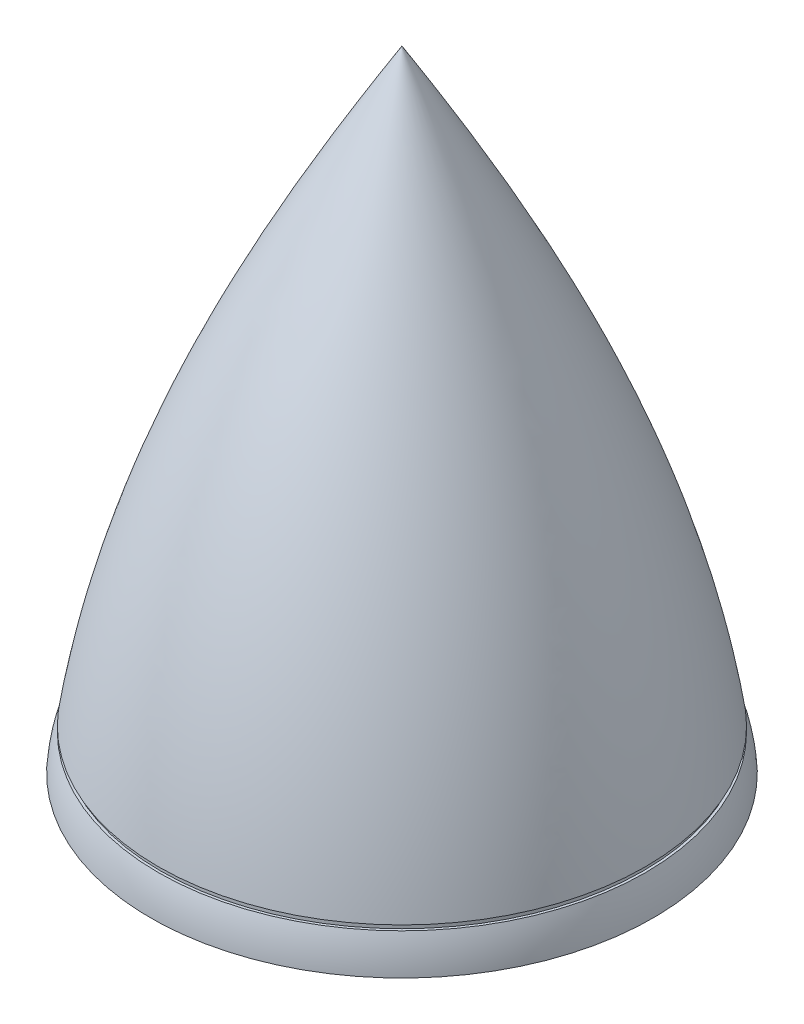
ISO-10303-21;
HEADER;
FILE_DESCRIPTION(('STEP AP214'),'2;1');
FILE_NAME('part.step','',(''),(''),'','','');
FILE_SCHEMA(('AUTOMOTIVE_DESIGN { 1 0 10303 214 1 1 1 1 }'));
ENDSEC;
DATA;
#1=APPLICATION_CONTEXT('core data for automotive mechanical design processes');
#2=APPLICATION_PROTOCOL_DEFINITION('international standard','automotive_design',2000,#1);
#3=PRODUCT_CONTEXT('',#1,'mechanical');
#4=PRODUCT('Part','Part','',(#3));
#5=PRODUCT_RELATED_PRODUCT_CATEGORY('part','',(#4));
#6=PRODUCT_DEFINITION_FORMATION('','',#4);
#7=PRODUCT_DEFINITION_CONTEXT('part definition',#1,'design');
#8=PRODUCT_DEFINITION('design','',#6,#7);
#9=PRODUCT_DEFINITION_SHAPE('','',#8);
#10=(LENGTH_UNIT() NAMED_UNIT(*) SI_UNIT(.MILLI.,.METRE.));
#11=(NAMED_UNIT(*) PLANE_ANGLE_UNIT() SI_UNIT($,.RADIAN.));
#12=(NAMED_UNIT(*) SI_UNIT($,.STERADIAN.) SOLID_ANGLE_UNIT());
#13=UNCERTAINTY_MEASURE_WITH_UNIT(LENGTH_MEASURE(1.E-05),#10,'distance_accuracy_value','');
#14=(GEOMETRIC_REPRESENTATION_CONTEXT(3) GLOBAL_UNCERTAINTY_ASSIGNED_CONTEXT((#13)) GLOBAL_UNIT_ASSIGNED_CONTEXT((#10,
#11,#12)) REPRESENTATION_CONTEXT('',''));
#15=CARTESIAN_POINT('',(0.,0.,0.));
#16=DIRECTION('',(0.,0.,1.));
#17=DIRECTION('',(1.,0.,0.));
#18=AXIS2_PLACEMENT_3D('',#15,#16,#17);
#19=CARTESIAN_POINT('',(0.,0.,0.));
#20=DIRECTION('',(0.,-1.,0.));
#21=DIRECTION('',(0.,0.,-1.));
#22=AXIS2_PLACEMENT_3D('',#19,#20,#21);
#23=PLANE('',#22);
#24=CARTESIAN_POINT('',(0.,0.,0.));
#25=DIRECTION('',(0.,-1.,0.));
#26=DIRECTION('',(0.,0.,-1.));
#27=AXIS2_PLACEMENT_3D('',#24,#25,#26);
#28=CIRCLE('',#27,475.);
#29=CARTESIAN_POINT('',(0.,0.,-475.));
#30=VERTEX_POINT('',#29);
#31=EDGE_CURVE('E61',#30,#30,#28,.T.);
#32=ORIENTED_EDGE('',*,*,#31,.F.);
#33=EDGE_LOOP('',(#32));
#34=FACE_BOUND('',#33,.T.);
#35=CARTESIAN_POINT('',(0.,0.,0.));
#36=DIRECTION('',(0.,-1.,0.));
#37=DIRECTION('',(0.,0.,-1.));
#38=AXIS2_PLACEMENT_3D('',#35,#36,#37);
#39=CIRCLE('',#38,480.);
#40=CARTESIAN_POINT('',(0.,0.,-480.));
#41=VERTEX_POINT('',#40);
#42=EDGE_CURVE('E11',#41,#41,#39,.T.);
#43=ORIENTED_EDGE('',*,*,#42,.T.);
#44=EDGE_LOOP('',(#43));
#45=FACE_BOUND('',#44,.T.);
#46=ADVANCED_FACE('F40',(#34,#45),#23,.T.);
#47=CARTESIAN_POINT('',(480.,0.,0.));
#48=CARTESIAN_POINT('',(416.533314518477,416.979658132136,0.));
#49=CARTESIAN_POINT('',(214.650703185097,803.689580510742,0.));
#50=CARTESIAN_POINT('',(0.,1160.,0.));
#51=B_SPLINE_CURVE_WITH_KNOTS('',3,(#47,#48,#49,#50),.UNSPECIFIED.,.F.,.F.,(4,4),(0.,1.),.UNSPECIFIED.);
#52=CARTESIAN_POINT('',(0.,0.,0.));
#53=DIRECTION('',(0.,-1.,0.));
#54=AXIS1_PLACEMENT('',#52,#53);
#55=SURFACE_OF_REVOLUTION('',#51,#54);
#56=CARTESIAN_POINT('',(0.,1160.,0.));
#57=VERTEX_POINT('',#56);
#58=VERTEX_LOOP('',#57);
#59=FACE_BOUND('',#58,.T.);
#60=ORIENTED_EDGE('',*,*,#42,.F.);
#61=EDGE_LOOP('',(#60));
#62=FACE_BOUND('',#61,.T.);
#63=ADVANCED_FACE('F49',(#59,#62),#55,.F.);
#64=CARTESIAN_POINT('',(-200.,-10.,0.));
#65=DIRECTION('',(0.,1.,0.));
#66=DIRECTION('',(0.,0.,1.));
#67=AXIS2_PLACEMENT_3D('',#64,#65,#66);
#68=PLANE('',#67);
#69=CARTESIAN_POINT('',(0.,-10.,0.));
#70=DIRECTION('',(0.,-1.,0.));
#71=DIRECTION('',(0.,0.,-1.));
#72=AXIS2_PLACEMENT_3D('',#69,#70,#71);
#73=CIRCLE('',#72,200.);
#74=CARTESIAN_POINT('',(0.,-10.,-200.));
#75=VERTEX_POINT('',#74);
#76=EDGE_CURVE('E46',#75,#75,#73,.T.);
#77=ORIENTED_EDGE('',*,*,#76,.T.);
#78=EDGE_LOOP('',(#77));
#79=FACE_BOUND('',#78,.T.);
#80=ADVANCED_FACE('F52',(#79),#68,.F.);
#81=CARTESIAN_POINT('',(0.,-10.,0.));
#82=DIRECTION('',(0.,-1.,0.));
#83=DIRECTION('',(0.,0.,-1.));
#84=AXIS2_PLACEMENT_3D('',#81,#82,#83);
#85=CYLINDRICAL_SURFACE('',#84,200.);
#86=ORIENTED_EDGE('',*,*,#76,.F.);
#87=EDGE_LOOP('',(#86));
#88=FACE_BOUND('',#87,.T.);
#89=CARTESIAN_POINT('',(0.,-40.,0.));
#90=DIRECTION('',(0.,-1.,0.));
#91=DIRECTION('',(0.,0.,-1.));
#92=AXIS2_PLACEMENT_3D('',#89,#90,#91);
#93=CIRCLE('',#92,200.);
#94=CARTESIAN_POINT('',(0.,-40.,-200.));
#95=VERTEX_POINT('',#94);
#96=EDGE_CURVE('E118',#95,#95,#93,.T.);
#97=ORIENTED_EDGE('',*,*,#96,.T.);
#98=EDGE_LOOP('',(#97));
#99=FACE_BOUND('',#98,.T.);
#100=ADVANCED_FACE('F131',(#88,#99),#85,.F.);
#101=CARTESIAN_POINT('',(-210.,-40.,0.));
#102=DIRECTION('',(0.,1.,0.));
#103=DIRECTION('',(0.,0.,1.));
#104=AXIS2_PLACEMENT_3D('',#101,#102,#103);
#105=PLANE('',#104);
#106=ORIENTED_EDGE('',*,*,#96,.F.);
#107=EDGE_LOOP('',(#106));
#108=FACE_BOUND('',#107,.T.);
#109=CARTESIAN_POINT('',(0.,-40.,0.));
#110=DIRECTION('',(0.,-1.,0.));
#111=DIRECTION('',(0.,0.,-1.));
#112=AXIS2_PLACEMENT_3D('',#109,#110,#111);
#113=CIRCLE('',#112,210.);
#114=CARTESIAN_POINT('',(0.,-40.,-210.));
#115=VERTEX_POINT('',#114);
#116=EDGE_CURVE('E115',#115,#115,#113,.T.);
#117=ORIENTED_EDGE('',*,*,#116,.T.);
#118=EDGE_LOOP('',(#117));
#119=FACE_BOUND('',#118,.T.);
#120=ADVANCED_FACE('F135',(#108,#119),#105,.F.);
#121=CARTESIAN_POINT('',(-260.,-20.,0.));
#122=CARTESIAN_POINT('',(-240.344013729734,-39.227117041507,0.));
#123=CARTESIAN_POINT('',(-210.,-40.,0.));
#124=B_SPLINE_CURVE_WITH_KNOTS('',2,(#121,#122,#123),.UNSPECIFIED.,.F.,.F.,(3,3),(0.,1.),.UNSPECIFIED.);
#125=CARTESIAN_POINT('',(0.,-10.,0.));
#126=DIRECTION('',(0.,-1.,0.));
#127=AXIS1_PLACEMENT('',#125,#126);
#128=SURFACE_OF_REVOLUTION('',#124,#127);
#129=ORIENTED_EDGE('',*,*,#116,.F.);
#130=EDGE_LOOP('',(#129));
#131=FACE_BOUND('',#130,.T.);
#132=CARTESIAN_POINT('',(0.,-20.,0.));
#133=DIRECTION('',(0.,-1.,0.));
#134=DIRECTION('',(0.,0.,-1.));
#135=AXIS2_PLACEMENT_3D('',#132,#133,#134);
#136=CIRCLE('',#135,260.);
#137=CARTESIAN_POINT('',(0.,-20.,-260.));
#138=VERTEX_POINT('',#137);
#139=EDGE_CURVE('E112',#138,#138,#136,.T.);
#140=ORIENTED_EDGE('',*,*,#139,.T.);
#141=EDGE_LOOP('',(#140));
#142=FACE_BOUND('',#141,.T.);
#143=ADVANCED_FACE('F139',(#131,#142),#128,.T.);
#144=CARTESIAN_POINT('',(-275.,-20.,0.));
#145=DIRECTION('',(0.,1.,0.));
#146=DIRECTION('',(0.,0.,1.));
#147=AXIS2_PLACEMENT_3D('',#144,#145,#146);
#148=PLANE('',#147);
#149=ORIENTED_EDGE('',*,*,#139,.F.);
#150=EDGE_LOOP('',(#149));
#151=FACE_BOUND('',#150,.T.);
#152=CARTESIAN_POINT('',(0.,-20.,0.));
#153=DIRECTION('',(0.,-1.,0.));
#154=DIRECTION('',(0.,0.,-1.));
#155=AXIS2_PLACEMENT_3D('',#152,#153,#154);
#156=CIRCLE('',#155,275.);
#157=CARTESIAN_POINT('',(0.,-20.,-275.));
#158=VERTEX_POINT('',#157);
#159=EDGE_CURVE('E109',#158,#158,#156,.T.);
#160=ORIENTED_EDGE('',*,*,#159,.T.);
#161=EDGE_LOOP('',(#160));
#162=FACE_BOUND('',#161,.T.);
#163=ADVANCED_FACE('F143',(#151,#162),#148,.F.);
#164=CARTESIAN_POINT('',(0.,-78.0000000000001,0.));
#165=DIRECTION('',(0.,-1.,0.));
#166=DIRECTION('',(0.,0.,-1.));
#167=AXIS2_PLACEMENT_3D('',#164,#165,#166);
#168=CONICAL_SURFACE('',#167,300.,0.406970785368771);
#169=ORIENTED_EDGE('',*,*,#159,.F.);
#170=EDGE_LOOP('',(#169));
#171=FACE_BOUND('',#170,.T.);
#172=CARTESIAN_POINT('',(0.,-78.0000000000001,0.));
#173=DIRECTION('',(0.,-1.,0.));
#174=DIRECTION('',(0.,0.,-1.));
#175=AXIS2_PLACEMENT_3D('',#172,#173,#174);
#176=CIRCLE('',#175,300.);
#177=CARTESIAN_POINT('',(0.,-78.0000000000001,-300.));
#178=VERTEX_POINT('',#177);
#179=EDGE_CURVE('E106',#178,#178,#176,.T.);
#180=ORIENTED_EDGE('',*,*,#179,.T.);
#181=EDGE_LOOP('',(#180));
#182=FACE_BOUND('',#181,.T.);
#183=ADVANCED_FACE('F147',(#171,#182),#168,.F.);
#184=CARTESIAN_POINT('',(-330.,-78.,0.));
#185=DIRECTION('',(0.,1.,0.));
#186=DIRECTION('',(0.,0.,1.));
#187=AXIS2_PLACEMENT_3D('',#184,#185,#186);
#188=PLANE('',#187);
#189=ORIENTED_EDGE('',*,*,#179,.F.);
#190=EDGE_LOOP('',(#189));
#191=FACE_BOUND('',#190,.T.);
#192=CARTESIAN_POINT('',(0.,-78.,0.));
#193=DIRECTION('',(0.,-1.,0.));
#194=DIRECTION('',(0.,0.,-1.));
#195=AXIS2_PLACEMENT_3D('',#192,#193,#194);
#196=CIRCLE('',#195,330.);
#197=CARTESIAN_POINT('',(0.,-78.,-330.));
#198=VERTEX_POINT('',#197);
#199=EDGE_CURVE('E103',#198,#198,#196,.T.);
#200=ORIENTED_EDGE('',*,*,#199,.T.);
#201=EDGE_LOOP('',(#200));
#202=FACE_BOUND('',#201,.T.);
#203=ADVANCED_FACE('F151',(#191,#202),#188,.F.);
#204=CARTESIAN_POINT('',(-375.,-20.,0.));
#205=CARTESIAN_POINT('',(-359.950480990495,-55.2701083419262,0.));
#206=CARTESIAN_POINT('',(-330.,-78.,0.));
#207=B_SPLINE_CURVE_WITH_KNOTS('',2,(#204,#205,#206),.UNSPECIFIED.,.F.,.F.,(3,3),(0.,1.),.UNSPECIFIED.);
#208=CARTESIAN_POINT('',(0.,-10.,0.));
#209=DIRECTION('',(0.,-1.,0.));
#210=AXIS1_PLACEMENT('',#208,#209);
#211=SURFACE_OF_REVOLUTION('',#207,#210);
#212=ORIENTED_EDGE('',*,*,#199,.F.);
#213=EDGE_LOOP('',(#212));
#214=FACE_BOUND('',#213,.T.);
#215=CARTESIAN_POINT('',(0.,-20.0000000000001,0.));
#216=DIRECTION('',(0.,-1.,0.));
#217=DIRECTION('',(0.,0.,-1.));
#218=AXIS2_PLACEMENT_3D('',#215,#216,#217);
#219=CIRCLE('',#218,375.);
#220=CARTESIAN_POINT('',(0.,-20.0000000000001,-375.));
#221=VERTEX_POINT('',#220);
#222=EDGE_CURVE('E100',#221,#221,#219,.T.);
#223=ORIENTED_EDGE('',*,*,#222,.T.);
#224=EDGE_LOOP('',(#223));
#225=FACE_BOUND('',#224,.T.);
#226=ADVANCED_FACE('F155',(#214,#225),#211,.T.);
#227=CARTESIAN_POINT('',(-390.,-20.,0.));
#228=DIRECTION('',(0.,1.,0.));
#229=DIRECTION('',(0.,0.,1.));
#230=AXIS2_PLACEMENT_3D('',#227,#228,#229);
#231=PLANE('',#230);
#232=ORIENTED_EDGE('',*,*,#222,.F.);
#233=EDGE_LOOP('',(#232));
#234=FACE_BOUND('',#233,.T.);
#235=CARTESIAN_POINT('',(0.,-20.,0.));
#236=DIRECTION('',(0.,-1.,0.));
#237=DIRECTION('',(0.,0.,-1.));
#238=AXIS2_PLACEMENT_3D('',#235,#236,#237);
#239=CIRCLE('',#238,390.);
#240=CARTESIAN_POINT('',(0.,-20.,-390.));
#241=VERTEX_POINT('',#240);
#242=EDGE_CURVE('E97',#241,#241,#239,.T.);
#243=ORIENTED_EDGE('',*,*,#242,.T.);
#244=EDGE_LOOP('',(#243));
#245=FACE_BOUND('',#244,.T.);
#246=ADVANCED_FACE('F159',(#234,#245),#231,.F.);
#247=CARTESIAN_POINT('',(-419.317162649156,-83.0000000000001,0.));
#248=CARTESIAN_POINT('',(-407.346499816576,-50.2525661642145,0.));
#249=CARTESIAN_POINT('',(-390.,-20.,0.));
#250=B_SPLINE_CURVE_WITH_KNOTS('',2,(#247,#248,#249),.UNSPECIFIED.,.F.,.F.,(3,3),(0.,1.),.UNSPECIFIED.);
#251=CARTESIAN_POINT('',(0.,-10.,0.));
#252=DIRECTION('',(0.,-1.,0.));
#253=AXIS1_PLACEMENT('',#251,#252);
#254=SURFACE_OF_REVOLUTION('',#250,#253);
#255=ORIENTED_EDGE('',*,*,#242,.F.);
#256=EDGE_LOOP('',(#255));
#257=FACE_BOUND('',#256,.T.);
#258=CARTESIAN_POINT('',(0.,-83.,0.));
#259=DIRECTION('',(0.,-1.,0.));
#260=DIRECTION('',(0.,0.,-1.));
#261=AXIS2_PLACEMENT_3D('',#258,#259,#260);
#262=CIRCLE('',#261,419.317162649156);
#263=CARTESIAN_POINT('',(0.,-83.,-419.317162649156));
#264=VERTEX_POINT('',#263);
#265=EDGE_CURVE('E94',#264,#264,#262,.T.);
#266=ORIENTED_EDGE('',*,*,#265,.T.);
#267=EDGE_LOOP('',(#266));
#268=FACE_BOUND('',#267,.T.);
#269=ADVANCED_FACE('F180',(#257,#268),#254,.T.);
#270=CARTESIAN_POINT('',(-424.150885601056,-83.,0.));
#271=DIRECTION('',(0.,1.,0.));
#272=DIRECTION('',(0.,0.,1.));
#273=AXIS2_PLACEMENT_3D('',#270,#271,#272);
#274=PLANE('',#273);
#275=ORIENTED_EDGE('',*,*,#265,.F.);
#276=EDGE_LOOP('',(#275));
#277=FACE_BOUND('',#276,.T.);
#278=CARTESIAN_POINT('',(0.,-83.0000000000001,0.));
#279=DIRECTION('',(0.,-1.,0.));
#280=DIRECTION('',(0.,0.,-1.));
#281=AXIS2_PLACEMENT_3D('',#278,#279,#280);
#282=CIRCLE('',#281,424.150885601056);
#283=CARTESIAN_POINT('',(0.,-83.0000000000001,-424.150885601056));
#284=VERTEX_POINT('',#283);
#285=EDGE_CURVE('E91',#284,#284,#282,.T.);
#286=ORIENTED_EDGE('',*,*,#285,.T.);
#287=EDGE_LOOP('',(#286));
#288=FACE_BOUND('',#287,.T.);
#289=ADVANCED_FACE('F183',(#277,#288),#274,.F.);
#290=CARTESIAN_POINT('',(-440.,-20.0000000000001,0.));
#291=CARTESIAN_POINT('',(-438.14458064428,-53.1305732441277,0.));
#292=CARTESIAN_POINT('',(-424.150885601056,-83.0000000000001,0.));
#293=B_SPLINE_CURVE_WITH_KNOTS('',2,(#290,#291,#292),.UNSPECIFIED.,.F.,.F.,(3,3),(0.,1.),.UNSPECIFIED.);
#294=CARTESIAN_POINT('',(0.,-10.,0.));
#295=DIRECTION('',(0.,-1.,0.));
#296=AXIS1_PLACEMENT('',#294,#295);
#297=SURFACE_OF_REVOLUTION('',#293,#296);
#298=ORIENTED_EDGE('',*,*,#285,.F.);
#299=EDGE_LOOP('',(#298));
#300=FACE_BOUND('',#299,.T.);
#301=CARTESIAN_POINT('',(0.,-20.0000000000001,0.));
#302=DIRECTION('',(0.,-1.,0.));
#303=DIRECTION('',(0.,0.,-1.));
#304=AXIS2_PLACEMENT_3D('',#301,#302,#303);
#305=CIRCLE('',#304,440.);
#306=CARTESIAN_POINT('',(0.,-20.0000000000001,-440.));
#307=VERTEX_POINT('',#306);
#308=EDGE_CURVE('E88',#307,#307,#305,.T.);
#309=ORIENTED_EDGE('',*,*,#308,.T.);
#310=EDGE_LOOP('',(#309));
#311=FACE_BOUND('',#310,.T.);
#312=ADVANCED_FACE('F187',(#300,#311),#297,.T.);
#313=CARTESIAN_POINT('',(-460.,-20.0000000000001,0.));
#314=DIRECTION('',(0.,1.,0.));
#315=DIRECTION('',(0.,0.,1.));
#316=AXIS2_PLACEMENT_3D('',#313,#314,#315);
#317=PLANE('',#316);
#318=ORIENTED_EDGE('',*,*,#308,.F.);
#319=EDGE_LOOP('',(#318));
#320=FACE_BOUND('',#319,.T.);
#321=CARTESIAN_POINT('',(0.,-20.0000000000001,0.));
#322=DIRECTION('',(0.,-1.,0.));
#323=DIRECTION('',(0.,0.,-1.));
#324=AXIS2_PLACEMENT_3D('',#321,#322,#323);
#325=CIRCLE('',#324,460.);
#326=CARTESIAN_POINT('',(0.,-20.0000000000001,-460.));
#327=VERTEX_POINT('',#326);
#328=EDGE_CURVE('E85',#327,#327,#325,.T.);
#329=ORIENTED_EDGE('',*,*,#328,.T.);
#330=EDGE_LOOP('',(#329));
#331=FACE_BOUND('',#330,.T.);
#332=ADVANCED_FACE('F191',(#320,#331),#317,.F.);
#333=CARTESIAN_POINT('',(0.,-70.,0.));
#334=DIRECTION('',(0.,-1.,0.));
#335=DIRECTION('',(0.,0.,-1.));
#336=AXIS2_PLACEMENT_3D('',#333,#334,#335);
#337=CONICAL_SURFACE('',#336,487.,0.495133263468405);
#338=ORIENTED_EDGE('',*,*,#328,.F.);
#339=EDGE_LOOP('',(#338));
#340=FACE_BOUND('',#339,.T.);
#341=CARTESIAN_POINT('',(0.,-70.,0.));
#342=DIRECTION('',(0.,-1.,0.));
#343=DIRECTION('',(0.,0.,-1.));
#344=AXIS2_PLACEMENT_3D('',#341,#342,#343);
#345=CIRCLE('',#344,487.);
#346=CARTESIAN_POINT('',(0.,-70.,-487.));
#347=VERTEX_POINT('',#346);
#348=EDGE_CURVE('E82',#347,#347,#345,.T.);
#349=ORIENTED_EDGE('',*,*,#348,.T.);
#350=EDGE_LOOP('',(#349));
#351=FACE_BOUND('',#350,.T.);
#352=ADVANCED_FACE('F195',(#340,#351),#337,.F.);
#353=CARTESIAN_POINT('',(0.,-80.,0.));
#354=DIRECTION('',(0.,-1.,0.));
#355=DIRECTION('',(0.,0.,-1.));
#356=AXIS2_PLACEMENT_3D('',#353,#354,#355);
#357=CONICAL_SURFACE('',#356,490.,0.291456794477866);
#358=ORIENTED_EDGE('',*,*,#348,.F.);
#359=EDGE_LOOP('',(#358));
#360=FACE_BOUND('',#359,.T.);
#361=CARTESIAN_POINT('',(0.,-80.,0.));
#362=DIRECTION('',(0.,-1.,0.));
#363=DIRECTION('',(0.,0.,-1.));
#364=AXIS2_PLACEMENT_3D('',#361,#362,#363);
#365=CIRCLE('',#364,490.);
#366=CARTESIAN_POINT('',(0.,-80.,-490.));
#367=VERTEX_POINT('',#366);
#368=EDGE_CURVE('E79',#367,#367,#365,.T.);
#369=ORIENTED_EDGE('',*,*,#368,.T.);
#370=EDGE_LOOP('',(#369));
#371=FACE_BOUND('',#370,.T.);
#372=ADVANCED_FACE('F199',(#360,#371),#357,.F.);
#373=CARTESIAN_POINT('',(-495.,-80.,0.));
#374=DIRECTION('',(0.,1.,0.));
#375=DIRECTION('',(0.,0.,1.));
#376=AXIS2_PLACEMENT_3D('',#373,#374,#375);
#377=PLANE('',#376);
#378=ORIENTED_EDGE('',*,*,#368,.F.);
#379=EDGE_LOOP('',(#378));
#380=FACE_BOUND('',#379,.T.);
#381=CARTESIAN_POINT('',(0.,-80.0000000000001,0.));
#382=DIRECTION('',(0.,-1.,0.));
#383=DIRECTION('',(0.,0.,-1.));
#384=AXIS2_PLACEMENT_3D('',#381,#382,#383);
#385=CIRCLE('',#384,495.);
#386=CARTESIAN_POINT('',(0.,-80.0000000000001,-495.));
#387=VERTEX_POINT('',#386);
#388=EDGE_CURVE('E76',#387,#387,#385,.T.);
#389=ORIENTED_EDGE('',*,*,#388,.T.);
#390=EDGE_LOOP('',(#389));
#391=FACE_BOUND('',#390,.T.);
#392=ADVANCED_FACE('F203',(#380,#391),#377,.F.);
#393=CARTESIAN_POINT('',(-480.,-10.,0.));
#394=CARTESIAN_POINT('',(-492.487851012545,-43.9081255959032,0.));
#395=CARTESIAN_POINT('',(-495.,-80.0000000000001,0.));
#396=B_SPLINE_CURVE_WITH_KNOTS('',2,(#393,#394,#395),.UNSPECIFIED.,.F.,.F.,(3,3),(0.,1.),.UNSPECIFIED.);
#397=CARTESIAN_POINT('',(0.,-10.,0.));
#398=DIRECTION('',(0.,-1.,0.));
#399=AXIS1_PLACEMENT('',#397,#398);
#400=SURFACE_OF_REVOLUTION('',#396,#399);
#401=ORIENTED_EDGE('',*,*,#388,.F.);
#402=EDGE_LOOP('',(#401));
#403=FACE_BOUND('',#402,.T.);
#404=CARTESIAN_POINT('',(0.,-10.,0.));
#405=DIRECTION('',(0.,-1.,0.));
#406=DIRECTION('',(0.,0.,-1.));
#407=AXIS2_PLACEMENT_3D('',#404,#405,#406);
#408=CIRCLE('',#407,480.);
#409=CARTESIAN_POINT('',(0.,-10.,-480.));
#410=VERTEX_POINT('',#409);
#411=EDGE_CURVE('E66',#410,#410,#408,.T.);
#412=ORIENTED_EDGE('',*,*,#411,.T.);
#413=EDGE_LOOP('',(#412));
#414=FACE_BOUND('',#413,.T.);
#415=ADVANCED_FACE('F207',(#403,#414),#400,.T.);
#416=CARTESIAN_POINT('',(-475.,-10.,0.));
#417=DIRECTION('',(0.,-1.,0.));
#418=DIRECTION('',(0.,0.,-1.));
#419=AXIS2_PLACEMENT_3D('',#416,#417,#418);
#420=PLANE('',#419);
#421=ORIENTED_EDGE('',*,*,#411,.F.);
#422=EDGE_LOOP('',(#421));
#423=FACE_BOUND('',#422,.T.);
#424=CARTESIAN_POINT('',(0.,-10.,0.));
#425=DIRECTION('',(0.,-1.,0.));
#426=DIRECTION('',(0.,0.,-1.));
#427=AXIS2_PLACEMENT_3D('',#424,#425,#426);
#428=CIRCLE('',#427,475.);
#429=CARTESIAN_POINT('',(0.,-10.,-475.));
#430=VERTEX_POINT('',#429);
#431=EDGE_CURVE('E63',#430,#430,#428,.T.);
#432=ORIENTED_EDGE('',*,*,#431,.T.);
#433=EDGE_LOOP('',(#432));
#434=FACE_BOUND('',#433,.T.);
#435=ADVANCED_FACE('F211',(#423,#434),#420,.F.);
#436=CARTESIAN_POINT('',(0.,-10.,0.));
#437=DIRECTION('',(0.,-1.,0.));
#438=DIRECTION('',(0.,0.,-1.));
#439=AXIS2_PLACEMENT_3D('',#436,#437,#438);
#440=CYLINDRICAL_SURFACE('',#439,475.);
#441=ORIENTED_EDGE('',*,*,#431,.F.);
#442=EDGE_LOOP('',(#441));
#443=FACE_BOUND('',#442,.T.);
#444=ORIENTED_EDGE('',*,*,#31,.T.);
#445=EDGE_LOOP('',(#444));
#446=FACE_BOUND('',#445,.T.);
#447=ADVANCED_FACE('F221',(#443,#446),#440,.T.);
#448=CLOSED_SHELL('',(#46,#63,#80,#100,#120,#143,#163,#183,#203,#226,#246,#269,#289,#312,#332,
#352,#372,#392,#415,#435,#447));
#449=MANIFOLD_SOLID_BREP('B2',#448);
#450=ADVANCED_BREP_SHAPE_REPRESENTATION('',(#18,#449),#14);
#451=SHAPE_DEFINITION_REPRESENTATION(#9,#450);
ENDSEC;
END-ISO-10303-21;
